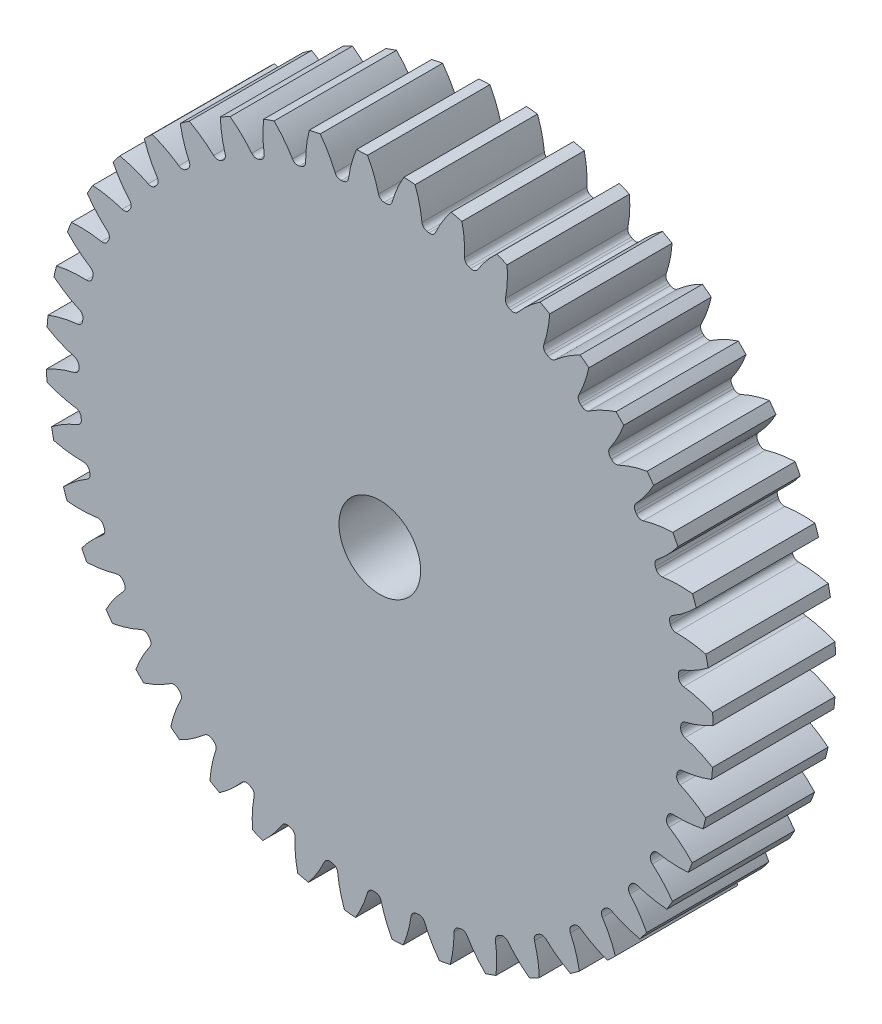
from build123d import *

# Parameters (mm, degrees)
SKETCH3_R         = 259.644444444
GEARBODY_DEPTH    = 95.25
TOOTHCUT_DEPTH    = 380.345538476
CIRPATTERN1_COUNT = 44
BOREDIA_R         = 31.75
BORE_DEPTH        = 12700


with BuildPart() as part:
    # Sketch3 → gearBody (new body)
    with BuildSketch(Plane.XY):
        Circle(SKETCH3_R)
    extrude(amount=GEARBODY_DEPTH)

    # Sketch2 → toothCut (cut, through all)
    with BuildSketch(Plane.XY):
        with BuildLine():
            ThreePointArc((234.190341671, -5.034244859), (234.206712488, -4.204233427), (234.220141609, -3.374169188))
            ThreePointArc((234.220141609, -3.374169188), (235.213033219, -0.58703165), (237.69927685, 1.016889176))
            ThreePointArc((237.69927685, 1.016889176), (248.952889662, 4.622758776), (259.644444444, 9.656321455))
            ThreePointArc((259.644444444, 9.656321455), (259.782092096, -4.663335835), (259.130595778, -18.96882724))
            ThreePointArc((259.130595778, -18.96882724), (248.626585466, -13.554783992), (237.509638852, -9.547341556))
            ThreePointArc((237.509638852, -9.547341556), (235.082562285, -7.855221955), (234.190341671, -5.034244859))
        make_face()
    toothcut = extrude(amount=TOOTHCUT_DEPTH, mode=Mode.SUBTRACT)

    # CirPattern1: toothCut ×44 about axis
    cirpattern1_axis = Axis((0, 0, 0), (0, 0, 1))
    for i in range(1, CIRPATTERN1_COUNT):
        add(toothcut.rotate(cirpattern1_axis, i * 360 / CIRPATTERN1_COUNT), mode=Mode.SUBTRACT)

    # boreDia → bore (cut, symmetric)
    with BuildSketch(Plane.XY):
        Circle(BOREDIA_R)
    extrude(amount=BORE_DEPTH, both=True, mode=Mode.SUBTRACT)


solid = part.part
